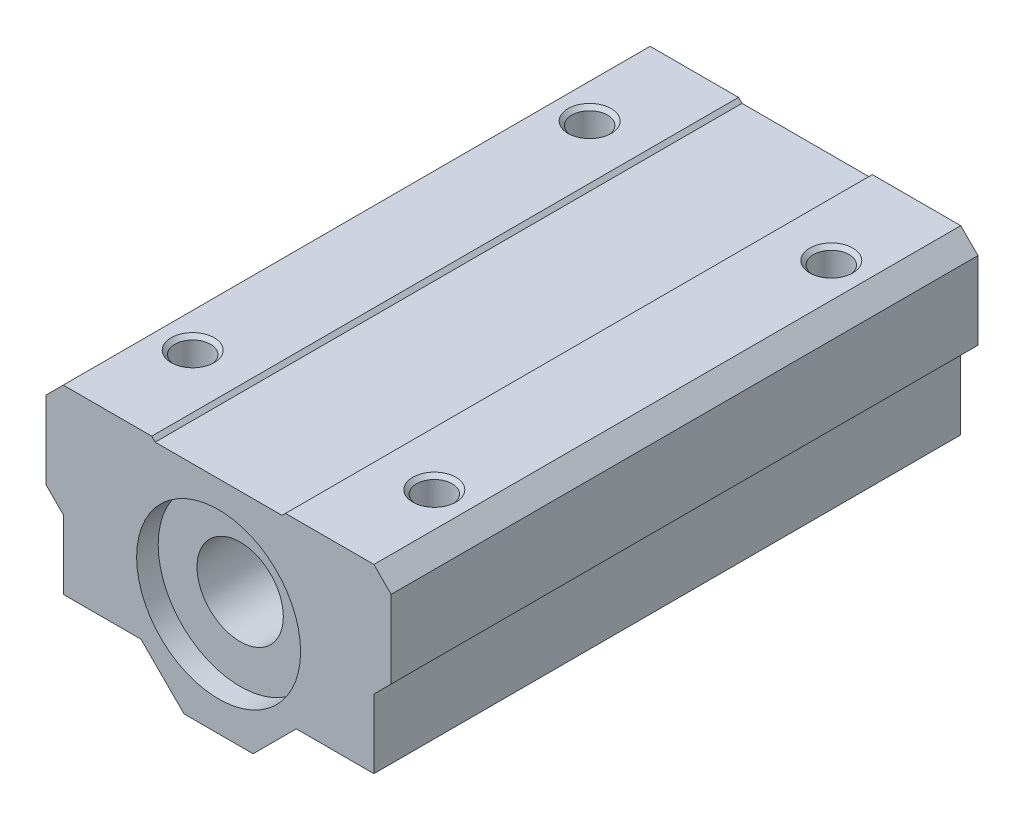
ISO-10303-21;
HEADER;
FILE_DESCRIPTION(('STEP AP214'),'2;1');
FILE_NAME('part.step','',(''),(''),'','','');
FILE_SCHEMA(('AUTOMOTIVE_DESIGN { 1 0 10303 214 1 1 1 1 }'));
ENDSEC;
DATA;
#1=APPLICATION_CONTEXT('core data for automotive mechanical design processes');
#2=APPLICATION_PROTOCOL_DEFINITION('international standard','automotive_design',2000,#1);
#3=PRODUCT_CONTEXT('',#1,'mechanical');
#4=PRODUCT('Part','Part','',(#3));
#5=PRODUCT_RELATED_PRODUCT_CATEGORY('part','',(#4));
#6=PRODUCT_DEFINITION_FORMATION('','',#4);
#7=PRODUCT_DEFINITION_CONTEXT('part definition',#1,'design');
#8=PRODUCT_DEFINITION('design','',#6,#7);
#9=PRODUCT_DEFINITION_SHAPE('','',#8);
#10=(LENGTH_UNIT() NAMED_UNIT(*) SI_UNIT(.MILLI.,.METRE.));
#11=(NAMED_UNIT(*) PLANE_ANGLE_UNIT() SI_UNIT($,.RADIAN.));
#12=(NAMED_UNIT(*) SI_UNIT($,.STERADIAN.) SOLID_ANGLE_UNIT());
#13=UNCERTAINTY_MEASURE_WITH_UNIT(LENGTH_MEASURE(1.E-05),#10,'distance_accuracy_value','');
#14=(GEOMETRIC_REPRESENTATION_CONTEXT(3) GLOBAL_UNCERTAINTY_ASSIGNED_CONTEXT((#13)) GLOBAL_UNIT_ASSIGNED_CONTEXT((#10,
#11,#12)) REPRESENTATION_CONTEXT('',''));
#15=CARTESIAN_POINT('',(0.,0.,0.));
#16=DIRECTION('',(0.,0.,1.));
#17=DIRECTION('',(1.,0.,0.));
#18=AXIS2_PLACEMENT_3D('',#15,#16,#17);
#19=CARTESIAN_POINT('',(-14.,13.,-11.));
#20=DIRECTION('',(0.,-1.,0.));
#21=DIRECTION('',(0.,0.,-1.));
#22=AXIS2_PLACEMENT_3D('',#19,#20,#21);
#23=CYLINDRICAL_SURFACE('',#22,2.067);
#24=CARTESIAN_POINT('',(-14.,-8.,-11.));
#25=DIRECTION('',(0.,-1.,0.));
#26=DIRECTION('',(0.,0.,-1.));
#27=AXIS2_PLACEMENT_3D('',#24,#25,#26);
#28=CIRCLE('',#27,2.067);
#29=CARTESIAN_POINT('',(-14.,-8.,-13.067));
#30=VERTEX_POINT('',#29);
#31=EDGE_CURVE('E19',#30,#30,#28,.F.);
#32=ORIENTED_EDGE('',*,*,#31,.F.);
#33=EDGE_LOOP('',(#32));
#34=FACE_BOUND('',#33,.T.);
#35=CARTESIAN_POINT('',(-14.,12.5670000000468,-11.));
#36=DIRECTION('',(0.,1.,0.));
#37=DIRECTION('',(0.,0.,1.));
#38=AXIS2_PLACEMENT_3D('',#35,#36,#37);
#39=CIRCLE('',#38,2.06699999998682);
#40=CARTESIAN_POINT('',(-14.,12.5670000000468,-8.93300000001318));
#41=VERTEX_POINT('',#40);
#42=EDGE_CURVE('E221',#41,#41,#39,.T.);
#43=ORIENTED_EDGE('',*,*,#42,.T.);
#44=EDGE_LOOP('',(#43));
#45=FACE_BOUND('',#44,.T.);
#46=ADVANCED_FACE('F16',(#34,#45),#23,.F.);
#47=CARTESIAN_POINT('',(-14.,13.,-57.));
#48=DIRECTION('',(0.,-1.,0.));
#49=DIRECTION('',(0.,0.,-1.));
#50=AXIS2_PLACEMENT_3D('',#47,#48,#49);
#51=CYLINDRICAL_SURFACE('',#50,2.067);
#52=CARTESIAN_POINT('',(-14.,-8.,-57.));
#53=DIRECTION('',(0.,-1.,0.));
#54=DIRECTION('',(0.,0.,-1.));
#55=AXIS2_PLACEMENT_3D('',#52,#53,#54);
#56=CIRCLE('',#55,2.067);
#57=CARTESIAN_POINT('',(-14.,-8.,-59.067));
#58=VERTEX_POINT('',#57);
#59=EDGE_CURVE('E208',#58,#58,#56,.F.);
#60=ORIENTED_EDGE('',*,*,#59,.F.);
#61=EDGE_LOOP('',(#60));
#62=FACE_BOUND('',#61,.T.);
#63=CARTESIAN_POINT('',(-14.,12.5670000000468,-57.));
#64=DIRECTION('',(0.,1.,0.));
#65=DIRECTION('',(0.,0.,1.));
#66=AXIS2_PLACEMENT_3D('',#63,#64,#65);
#67=CIRCLE('',#66,2.06699999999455);
#68=CARTESIAN_POINT('',(-14.,12.5670000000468,-54.9330000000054));
#69=VERTEX_POINT('',#68);
#70=EDGE_CURVE('E212',#69,#69,#67,.T.);
#71=ORIENTED_EDGE('',*,*,#70,.T.);
#72=EDGE_LOOP('',(#71));
#73=FACE_BOUND('',#72,.T.);
#74=ADVANCED_FACE('F272',(#62,#73),#51,.F.);
#75=CARTESIAN_POINT('',(14.,-8.,-11.));
#76=DIRECTION('',(0.,1.,0.));
#77=DIRECTION('',(0.,0.,1.));
#78=AXIS2_PLACEMENT_3D('',#75,#76,#77);
#79=CYLINDRICAL_SURFACE('',#78,2.067);
#80=CARTESIAN_POINT('',(14.,12.5670000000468,-11.));
#81=DIRECTION('',(0.,1.,0.));
#82=DIRECTION('',(0.,0.,1.));
#83=AXIS2_PLACEMENT_3D('',#80,#81,#82);
#84=CIRCLE('',#83,2.06699999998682);
#85=CARTESIAN_POINT('',(14.,12.5670000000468,-8.93300000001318));
#86=VERTEX_POINT('',#85);
#87=EDGE_CURVE('E233',#86,#86,#84,.T.);
#88=ORIENTED_EDGE('',*,*,#87,.T.);
#89=EDGE_LOOP('',(#88));
#90=FACE_BOUND('',#89,.T.);
#91=CARTESIAN_POINT('',(14.,-8.,-11.));
#92=DIRECTION('',(0.,1.,0.));
#93=DIRECTION('',(0.,0.,1.));
#94=AXIS2_PLACEMENT_3D('',#91,#92,#93);
#95=CIRCLE('',#94,2.067);
#96=CARTESIAN_POINT('',(14.,-8.,-8.933));
#97=VERTEX_POINT('',#96);
#98=EDGE_CURVE('E201',#97,#97,#95,.T.);
#99=ORIENTED_EDGE('',*,*,#98,.F.);
#100=EDGE_LOOP('',(#99));
#101=FACE_BOUND('',#100,.T.);
#102=ADVANCED_FACE('F275',(#90,#101),#79,.F.);
#103=CARTESIAN_POINT('',(14.,-8.,-57.));
#104=DIRECTION('',(0.,1.,0.));
#105=DIRECTION('',(0.,0.,1.));
#106=AXIS2_PLACEMENT_3D('',#103,#104,#105);
#107=CYLINDRICAL_SURFACE('',#106,2.067);
#108=CARTESIAN_POINT('',(14.,12.5670000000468,-57.));
#109=DIRECTION('',(0.,1.,0.));
#110=DIRECTION('',(0.,0.,1.));
#111=AXIS2_PLACEMENT_3D('',#108,#109,#110);
#112=CIRCLE('',#111,2.0670000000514);
#113=CARTESIAN_POINT('',(14.,12.5670000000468,-54.9329999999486));
#114=VERTEX_POINT('',#113);
#115=EDGE_CURVE('E230',#114,#114,#112,.T.);
#116=ORIENTED_EDGE('',*,*,#115,.T.);
#117=EDGE_LOOP('',(#116));
#118=FACE_BOUND('',#117,.T.);
#119=CARTESIAN_POINT('',(14.,-8.,-57.));
#120=DIRECTION('',(0.,1.,0.));
#121=DIRECTION('',(0.,0.,1.));
#122=AXIS2_PLACEMENT_3D('',#119,#120,#121);
#123=CIRCLE('',#122,2.067);
#124=CARTESIAN_POINT('',(14.,-8.,-54.933));
#125=VERTEX_POINT('',#124);
#126=EDGE_CURVE('E198',#125,#125,#123,.T.);
#127=ORIENTED_EDGE('',*,*,#126,.F.);
#128=EDGE_LOOP('',(#127));
#129=FACE_BOUND('',#128,.T.);
#130=ADVANCED_FACE('F513',(#118,#129),#107,.F.);
#131=CARTESIAN_POINT('',(14.,12.99999999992,-11.));
#132=DIRECTION('',(0.,1.,0.));
#133=DIRECTION('',(0.,0.,1.));
#134=AXIS2_PLACEMENT_3D('',#131,#132,#133);
#135=CONICAL_SURFACE('',#134,2.49999999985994,0.78539816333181);
#136=CARTESIAN_POINT('',(14.,12.9999999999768,-11.));
#137=DIRECTION('',(0.,1.,0.));
#138=DIRECTION('',(0.,0.,1.));
#139=AXIS2_PLACEMENT_3D('',#136,#137,#138);
#140=CIRCLE('',#139,2.49999999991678);
#141=CARTESIAN_POINT('',(14.,12.9999999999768,-8.50000000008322));
#142=VERTEX_POINT('',#141);
#143=EDGE_CURVE('E189',#142,#142,#140,.F.);
#144=ORIENTED_EDGE('',*,*,#143,.F.);
#145=EDGE_LOOP('',(#144));
#146=FACE_BOUND('',#145,.T.);
#147=ORIENTED_EDGE('',*,*,#87,.F.);
#148=EDGE_LOOP('',(#147));
#149=FACE_BOUND('',#148,.T.);
#150=ADVANCED_FACE('F510',(#146,#149),#135,.F.);
#151=CARTESIAN_POINT('',(14.,12.99999999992,-57.));
#152=DIRECTION('',(0.,1.,0.));
#153=DIRECTION('',(0.,0.,1.));
#154=AXIS2_PLACEMENT_3D('',#151,#152,#153);
#155=CONICAL_SURFACE('',#154,2.49999999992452,0.785398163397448);
#156=CARTESIAN_POINT('',(14.,12.9999999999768,-57.));
#157=DIRECTION('',(0.,1.,0.));
#158=DIRECTION('',(0.,0.,1.));
#159=AXIS2_PLACEMENT_3D('',#156,#157,#158);
#160=CIRCLE('',#159,2.49999999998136);
#161=CARTESIAN_POINT('',(14.,12.9999999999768,-54.5000000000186));
#162=VERTEX_POINT('',#161);
#163=EDGE_CURVE('E183',#162,#162,#160,.F.);
#164=ORIENTED_EDGE('',*,*,#163,.F.);
#165=EDGE_LOOP('',(#164));
#166=FACE_BOUND('',#165,.T.);
#167=ORIENTED_EDGE('',*,*,#115,.F.);
#168=EDGE_LOOP('',(#167));
#169=FACE_BOUND('',#168,.T.);
#170=ADVANCED_FACE('F311',(#166,#169),#155,.F.);
#171=CARTESIAN_POINT('',(7.75,13.,-68.));
#172=DIRECTION('',(-0.707106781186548,0.707106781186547,0.));
#173=DIRECTION('',(-0.707106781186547,-0.707106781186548,0.));
#174=AXIS2_PLACEMENT_3D('',#171,#172,#173);
#175=PLANE('',#174);
#176=DIRECTION('',(-0.707106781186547,-0.707106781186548,0.));
#177=VECTOR('',#176,1.);
#178=CARTESIAN_POINT('',(7.75,13.,-68.));
#179=LINE('',#178,#177);
#180=CARTESIAN_POINT('',(7.75,13.,-68.));
#181=VERTEX_POINT('',#180);
#182=CARTESIAN_POINT('',(7.35000000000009,12.6,-68.));
#183=VERTEX_POINT('',#182);
#184=EDGE_CURVE('E224',#181,#183,#179,.T.);
#185=ORIENTED_EDGE('',*,*,#184,.T.);
#186=DIRECTION('',(0.,0.,1.));
#187=VECTOR('',#186,1.);
#188=CARTESIAN_POINT('',(7.35000000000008,12.6,-68.));
#189=LINE('',#188,#187);
#190=CARTESIAN_POINT('',(7.35000000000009,12.6,0.));
#191=VERTEX_POINT('',#190);
#192=EDGE_CURVE('E180',#191,#183,#189,.F.);
#193=ORIENTED_EDGE('',*,*,#192,.F.);
#194=DIRECTION('',(-0.707106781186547,-0.707106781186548,0.));
#195=VECTOR('',#194,1.);
#196=CARTESIAN_POINT('',(7.75,13.,0.));
#197=LINE('',#196,#195);
#198=CARTESIAN_POINT('',(7.75,13.,0.));
#199=VERTEX_POINT('',#198);
#200=EDGE_CURVE('E228',#191,#199,#197,.F.);
#201=ORIENTED_EDGE('',*,*,#200,.T.);
#202=DIRECTION('',(0.,0.,1.));
#203=VECTOR('',#202,1.);
#204=CARTESIAN_POINT('',(7.75,13.,-68.));
#205=LINE('',#204,#203);
#206=EDGE_CURVE('E184',#181,#199,#205,.T.);
#207=ORIENTED_EDGE('',*,*,#206,.F.);
#208=EDGE_LOOP('',(#185,#193,#201,#207));
#209=FACE_BOUND('',#208,.T.);
#210=ADVANCED_FACE('F300',(#209),#175,.T.);
#211=CARTESIAN_POINT('',(-14.,13.0000000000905,-11.));
#212=DIRECTION('',(0.,1.,0.));
#213=DIRECTION('',(0.,0.,1.));
#214=AXIS2_PLACEMENT_3D('',#211,#212,#213);
#215=CONICAL_SURFACE('',#214,2.49999999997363,0.78539816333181);
#216=ORIENTED_EDGE('',*,*,#42,.F.);
#217=EDGE_LOOP('',(#216));
#218=FACE_BOUND('',#217,.T.);
#219=CARTESIAN_POINT('',(-14.,13.0000000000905,-11.));
#220=DIRECTION('',(0.,1.,0.));
#221=DIRECTION('',(0.,0.,1.));
#222=AXIS2_PLACEMENT_3D('',#219,#220,#221);
#223=CIRCLE('',#222,2.49999999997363);
#224=CARTESIAN_POINT('',(-14.,13.0000000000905,-8.50000000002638));
#225=VERTEX_POINT('',#224);
#226=EDGE_CURVE('E176',#225,#225,#223,.F.);
#227=ORIENTED_EDGE('',*,*,#226,.F.);
#228=EDGE_LOOP('',(#227));
#229=FACE_BOUND('',#228,.T.);
#230=ADVANCED_FACE('F298',(#218,#229),#215,.F.);
#231=CARTESIAN_POINT('',(-7.35000000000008,12.6,-68.));
#232=DIRECTION('',(0.707106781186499,0.707106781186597,0.));
#233=DIRECTION('',(-0.707106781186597,0.707106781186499,0.));
#234=AXIS2_PLACEMENT_3D('',#231,#232,#233);
#235=PLANE('',#234);
#236=DIRECTION('',(-0.707106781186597,0.707106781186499,0.));
#237=VECTOR('',#236,1.);
#238=CARTESIAN_POINT('',(-7.35000000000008,12.6,-68.));
#239=LINE('',#238,#237);
#240=CARTESIAN_POINT('',(-7.35000000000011,12.6,-68.));
#241=VERTEX_POINT('',#240);
#242=CARTESIAN_POINT('',(-7.75000000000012,13.,-68.));
#243=VERTEX_POINT('',#242);
#244=EDGE_CURVE('E215',#241,#243,#239,.T.);
#245=ORIENTED_EDGE('',*,*,#244,.T.);
#246=DIRECTION('',(0.,0.,1.));
#247=VECTOR('',#246,1.);
#248=CARTESIAN_POINT('',(-7.75000000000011,13.,-68.));
#249=LINE('',#248,#247);
#250=CARTESIAN_POINT('',(-7.75000000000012,13.,0.));
#251=VERTEX_POINT('',#250);
#252=EDGE_CURVE('E173',#251,#243,#249,.F.);
#253=ORIENTED_EDGE('',*,*,#252,.F.);
#254=DIRECTION('',(-0.707106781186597,0.707106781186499,0.));
#255=VECTOR('',#254,1.);
#256=CARTESIAN_POINT('',(-7.35000000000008,12.6,0.));
#257=LINE('',#256,#255);
#258=CARTESIAN_POINT('',(-7.35000000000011,12.6,0.));
#259=VERTEX_POINT('',#258);
#260=EDGE_CURVE('E219',#251,#259,#257,.F.);
#261=ORIENTED_EDGE('',*,*,#260,.T.);
#262=DIRECTION('',(0.,0.,1.));
#263=VECTOR('',#262,1.);
#264=CARTESIAN_POINT('',(-7.35000000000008,12.6,-68.));
#265=LINE('',#264,#263);
#266=EDGE_CURVE('E177',#241,#259,#265,.T.);
#267=ORIENTED_EDGE('',*,*,#266,.F.);
#268=EDGE_LOOP('',(#245,#253,#261,#267));
#269=FACE_BOUND('',#268,.T.);
#270=ADVANCED_FACE('F282',(#269),#235,.T.);
#271=CARTESIAN_POINT('',(-14.,13.0000000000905,-57.));
#272=DIRECTION('',(0.,1.,0.));
#273=DIRECTION('',(0.,0.,1.));
#274=AXIS2_PLACEMENT_3D('',#271,#272,#273);
#275=CONICAL_SURFACE('',#274,2.49999999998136,0.78539816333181);
#276=ORIENTED_EDGE('',*,*,#70,.F.);
#277=EDGE_LOOP('',(#276));
#278=FACE_BOUND('',#277,.T.);
#279=CARTESIAN_POINT('',(-14.,13.0000000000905,-57.));
#280=DIRECTION('',(0.,1.,0.));
#281=DIRECTION('',(0.,0.,1.));
#282=AXIS2_PLACEMENT_3D('',#279,#280,#281);
#283=CIRCLE('',#282,2.49999999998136);
#284=CARTESIAN_POINT('',(-14.,13.0000000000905,-54.5000000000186));
#285=VERTEX_POINT('',#284);
#286=EDGE_CURVE('E172',#285,#285,#283,.F.);
#287=ORIENTED_EDGE('',*,*,#286,.F.);
#288=EDGE_LOOP('',(#287));
#289=FACE_BOUND('',#288,.T.);
#290=ADVANCED_FACE('F278',(#278,#289),#275,.F.);
#291=CARTESIAN_POINT('',(-20.,11.,-68.));
#292=DIRECTION('',(-1.,0.,0.));
#293=DIRECTION('',(0.,0.,1.));
#294=AXIS2_PLACEMENT_3D('',#291,#292,#293);
#295=PLANE('',#294);
#296=DIRECTION('',(0.,1.,0.));
#297=VECTOR('',#296,1.);
#298=CARTESIAN_POINT('',(-20.,0.,-68.));
#299=LINE('',#298,#297);
#300=CARTESIAN_POINT('',(-20.,11.,-68.));
#301=VERTEX_POINT('',#300);
#302=CARTESIAN_POINT('',(-20.,2.,-68.));
#303=VERTEX_POINT('',#302);
#304=EDGE_CURVE('E401',#301,#303,#299,.F.);
#305=ORIENTED_EDGE('',*,*,#304,.T.);
#306=DIRECTION('',(0.,0.,1.));
#307=VECTOR('',#306,1.);
#308=CARTESIAN_POINT('',(-20.,2.,-68.));
#309=LINE('',#308,#307);
#310=CARTESIAN_POINT('',(-20.,2.,0.));
#311=VERTEX_POINT('',#310);
#312=EDGE_CURVE('E139',#311,#303,#309,.F.);
#313=ORIENTED_EDGE('',*,*,#312,.F.);
#314=DIRECTION('',(0.,1.,0.));
#315=VECTOR('',#314,1.);
#316=CARTESIAN_POINT('',(-20.,0.,0.));
#317=LINE('',#316,#315);
#318=CARTESIAN_POINT('',(-20.,11.,0.));
#319=VERTEX_POINT('',#318);
#320=EDGE_CURVE('E404',#319,#311,#317,.F.);
#321=ORIENTED_EDGE('',*,*,#320,.F.);
#322=DIRECTION('',(0.,0.,1.));
#323=VECTOR('',#322,1.);
#324=CARTESIAN_POINT('',(-20.,11.,-68.));
#325=LINE('',#324,#323);
#326=EDGE_CURVE('E165',#301,#319,#325,.T.);
#327=ORIENTED_EDGE('',*,*,#326,.F.);
#328=EDGE_LOOP('',(#305,#313,#321,#327));
#329=FACE_BOUND('',#328,.T.);
#330=ADVANCED_FACE('F281',(#329),#295,.T.);
#331=CARTESIAN_POINT('',(-20.,2.,-68.));
#332=DIRECTION('',(-0.707106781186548,-0.707106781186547,0.));
#333=DIRECTION('',(0.707106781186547,-0.707106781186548,0.));
#334=AXIS2_PLACEMENT_3D('',#331,#332,#333);
#335=PLANE('',#334);
#336=DIRECTION('',(0.707106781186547,-0.707106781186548,0.));
#337=VECTOR('',#336,1.);
#338=CARTESIAN_POINT('',(-20.,2.,-68.));
#339=LINE('',#338,#337);
#340=CARTESIAN_POINT('',(-18.,0.,-68.));
#341=VERTEX_POINT('',#340);
#342=EDGE_CURVE('E158',#303,#341,#339,.T.);
#343=ORIENTED_EDGE('',*,*,#342,.T.);
#344=DIRECTION('',(0.,0.,1.));
#345=VECTOR('',#344,1.);
#346=CARTESIAN_POINT('',(-18.,0.,-68.));
#347=LINE('',#346,#345);
#348=CARTESIAN_POINT('',(-18.,0.,0.));
#349=VERTEX_POINT('',#348);
#350=EDGE_CURVE('E146',#349,#341,#347,.F.);
#351=ORIENTED_EDGE('',*,*,#350,.F.);
#352=DIRECTION('',(0.707106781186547,-0.707106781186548,0.));
#353=VECTOR('',#352,1.);
#354=CARTESIAN_POINT('',(-20.,2.,0.));
#355=LINE('',#354,#353);
#356=EDGE_CURVE('E407',#311,#349,#355,.T.);
#357=ORIENTED_EDGE('',*,*,#356,.F.);
#358=ORIENTED_EDGE('',*,*,#312,.T.);
#359=EDGE_LOOP('',(#343,#351,#357,#358));
#360=FACE_BOUND('',#359,.T.);
#361=ADVANCED_FACE('F164',(#360),#335,.T.);
#362=CARTESIAN_POINT('',(-18.,0.,-68.));
#363=DIRECTION('',(-1.,0.,0.));
#364=DIRECTION('',(0.,0.,1.));
#365=AXIS2_PLACEMENT_3D('',#362,#363,#364);
#366=PLANE('',#365);
#367=DIRECTION('',(0.,1.,0.));
#368=VECTOR('',#367,1.);
#369=CARTESIAN_POINT('',(-18.,0.,-68.));
#370=LINE('',#369,#368);
#371=CARTESIAN_POINT('',(-18.,-8.,-68.));
#372=VERTEX_POINT('',#371);
#373=EDGE_CURVE('E150',#341,#372,#370,.F.);
#374=ORIENTED_EDGE('',*,*,#373,.T.);
#375=DIRECTION('',(0.,0.,-1.));
#376=VECTOR('',#375,1.);
#377=CARTESIAN_POINT('',(-18.,-8.,-68.));
#378=LINE('',#377,#376);
#379=CARTESIAN_POINT('',(-18.,-8.,0.));
#380=VERTEX_POINT('',#379);
#381=EDGE_CURVE('E209',#380,#372,#378,.T.);
#382=ORIENTED_EDGE('',*,*,#381,.F.);
#383=DIRECTION('',(0.,1.,0.));
#384=VECTOR('',#383,1.);
#385=CARTESIAN_POINT('',(-18.,0.,0.));
#386=LINE('',#385,#384);
#387=EDGE_CURVE('E151',#349,#380,#386,.F.);
#388=ORIENTED_EDGE('',*,*,#387,.F.);
#389=ORIENTED_EDGE('',*,*,#350,.T.);
#390=EDGE_LOOP('',(#374,#382,#388,#389));
#391=FACE_BOUND('',#390,.T.);
#392=ADVANCED_FACE('F148',(#391),#366,.T.);
#393=CARTESIAN_POINT('',(-18.,-8.,-68.));
#394=DIRECTION('',(0.,-1.,0.));
#395=DIRECTION('',(0.,0.,-1.));
#396=AXIS2_PLACEMENT_3D('',#393,#394,#395);
#397=PLANE('',#396);
#398=ORIENTED_EDGE('',*,*,#59,.T.);
#399=EDGE_LOOP('',(#398));
#400=FACE_BOUND('',#399,.T.);
#401=DIRECTION('',(1.,0.,0.));
#402=VECTOR('',#401,1.);
#403=CARTESIAN_POINT('',(0.,-8.,-68.));
#404=LINE('',#403,#402);
#405=CARTESIAN_POINT('',(-9.,-8.,-68.));
#406=VERTEX_POINT('',#405);
#407=EDGE_CURVE('E162',#372,#406,#404,.T.);
#408=ORIENTED_EDGE('',*,*,#407,.T.);
#409=DIRECTION('',(0.,0.,1.));
#410=VECTOR('',#409,1.);
#411=CARTESIAN_POINT('',(-9.,-8.,-68.));
#412=LINE('',#411,#410);
#413=CARTESIAN_POINT('',(-9.,-8.,0.));
#414=VERTEX_POINT('',#413);
#415=EDGE_CURVE('E206',#414,#406,#412,.F.);
#416=ORIENTED_EDGE('',*,*,#415,.F.);
#417=DIRECTION('',(1.,0.,0.));
#418=VECTOR('',#417,1.);
#419=CARTESIAN_POINT('',(0.,-8.,0.));
#420=LINE('',#419,#418);
#421=EDGE_CURVE('E446',#380,#414,#420,.T.);
#422=ORIENTED_EDGE('',*,*,#421,.F.);
#423=ORIENTED_EDGE('',*,*,#381,.T.);
#424=EDGE_LOOP('',(#408,#416,#422,#423));
#425=FACE_BOUND('',#424,.T.);
#426=ORIENTED_EDGE('',*,*,#31,.T.);
#427=EDGE_LOOP('',(#426));
#428=FACE_BOUND('',#427,.T.);
#429=ADVANCED_FACE('F269',(#400,#425,#428),#397,.T.);
#430=CARTESIAN_POINT('',(-9.,-8.,-68.));
#431=DIRECTION('',(-0.707106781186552,-0.707106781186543,0.));
#432=DIRECTION('',(0.707106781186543,-0.707106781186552,0.));
#433=AXIS2_PLACEMENT_3D('',#430,#431,#432);
#434=PLANE('',#433);
#435=DIRECTION('',(0.707106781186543,-0.707106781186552,0.));
#436=VECTOR('',#435,1.);
#437=CARTESIAN_POINT('',(-9.,-8.,-68.));
#438=LINE('',#437,#436);
#439=CARTESIAN_POINT('',(-4.,-13.,-68.));
#440=VERTEX_POINT('',#439);
#441=EDGE_CURVE('E440',#406,#440,#438,.T.);
#442=ORIENTED_EDGE('',*,*,#441,.T.);
#443=DIRECTION('',(0.,0.,-1.));
#444=VECTOR('',#443,1.);
#445=CARTESIAN_POINT('',(-4.,-13.,-68.));
#446=LINE('',#445,#444);
#447=CARTESIAN_POINT('',(-4.,-13.,0.));
#448=VERTEX_POINT('',#447);
#449=EDGE_CURVE('E204',#448,#440,#446,.T.);
#450=ORIENTED_EDGE('',*,*,#449,.F.);
#451=DIRECTION('',(0.707106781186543,-0.707106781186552,0.));
#452=VECTOR('',#451,1.);
#453=CARTESIAN_POINT('',(-9.,-8.,0.));
#454=LINE('',#453,#452);
#455=EDGE_CURVE('E447',#414,#448,#454,.T.);
#456=ORIENTED_EDGE('',*,*,#455,.F.);
#457=ORIENTED_EDGE('',*,*,#415,.T.);
#458=EDGE_LOOP('',(#442,#450,#456,#457));
#459=FACE_BOUND('',#458,.T.);
#460=ADVANCED_FACE('F385',(#459),#434,.T.);
#461=CARTESIAN_POINT('',(-4.,-13.,-68.));
#462=DIRECTION('',(0.,-1.,0.));
#463=DIRECTION('',(0.,0.,-1.));
#464=AXIS2_PLACEMENT_3D('',#461,#462,#463);
#465=PLANE('',#464);
#466=DIRECTION('',(1.,0.,0.));
#467=VECTOR('',#466,1.);
#468=CARTESIAN_POINT('',(0.,-13.,-68.));
#469=LINE('',#468,#467);
#470=CARTESIAN_POINT('',(4.,-13.,-68.));
#471=VERTEX_POINT('',#470);
#472=EDGE_CURVE('E437',#440,#471,#469,.T.);
#473=ORIENTED_EDGE('',*,*,#472,.T.);
#474=DIRECTION('',(0.,0.,1.));
#475=VECTOR('',#474,1.);
#476=CARTESIAN_POINT('',(4.,-13.,-68.));
#477=LINE('',#476,#475);
#478=CARTESIAN_POINT('',(4.,-13.,0.));
#479=VERTEX_POINT('',#478);
#480=EDGE_CURVE('E202',#479,#471,#477,.F.);
#481=ORIENTED_EDGE('',*,*,#480,.F.);
#482=DIRECTION('',(1.,0.,0.));
#483=VECTOR('',#482,1.);
#484=CARTESIAN_POINT('',(0.,-13.,0.));
#485=LINE('',#484,#483);
#486=EDGE_CURVE('E449',#448,#479,#485,.T.);
#487=ORIENTED_EDGE('',*,*,#486,.F.);
#488=ORIENTED_EDGE('',*,*,#449,.T.);
#489=EDGE_LOOP('',(#473,#481,#487,#488));
#490=FACE_BOUND('',#489,.T.);
#491=ADVANCED_FACE('F381',(#490),#465,.T.);
#492=CARTESIAN_POINT('',(4.,-13.,-68.));
#493=DIRECTION('',(0.707106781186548,-0.707106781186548,0.));
#494=DIRECTION('',(0.707106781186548,0.707106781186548,0.));
#495=AXIS2_PLACEMENT_3D('',#492,#493,#494);
#496=PLANE('',#495);
#497=DIRECTION('',(0.707106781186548,0.707106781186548,0.));
#498=VECTOR('',#497,1.);
#499=CARTESIAN_POINT('',(4.,-13.,-68.));
#500=LINE('',#499,#498);
#501=CARTESIAN_POINT('',(9.,-8.,-68.));
#502=VERTEX_POINT('',#501);
#503=EDGE_CURVE('E434',#471,#502,#500,.T.);
#504=ORIENTED_EDGE('',*,*,#503,.T.);
#505=DIRECTION('',(0.,0.,-1.));
#506=VECTOR('',#505,1.);
#507=CARTESIAN_POINT('',(9.,-8.,-68.));
#508=LINE('',#507,#506);
#509=CARTESIAN_POINT('',(9.,-8.,0.));
#510=VERTEX_POINT('',#509);
#511=EDGE_CURVE('E199',#510,#502,#508,.T.);
#512=ORIENTED_EDGE('',*,*,#511,.F.);
#513=DIRECTION('',(0.707106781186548,0.707106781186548,0.));
#514=VECTOR('',#513,1.);
#515=CARTESIAN_POINT('',(4.,-13.,0.));
#516=LINE('',#515,#514);
#517=EDGE_CURVE('E473',#479,#510,#516,.T.);
#518=ORIENTED_EDGE('',*,*,#517,.F.);
#519=ORIENTED_EDGE('',*,*,#480,.T.);
#520=EDGE_LOOP('',(#504,#512,#518,#519));
#521=FACE_BOUND('',#520,.T.);
#522=ADVANCED_FACE('F377',(#521),#496,.T.);
#523=CARTESIAN_POINT('',(9.,-8.,-68.));
#524=DIRECTION('',(0.,-1.,0.));
#525=DIRECTION('',(0.,0.,-1.));
#526=AXIS2_PLACEMENT_3D('',#523,#524,#525);
#527=PLANE('',#526);
#528=ORIENTED_EDGE('',*,*,#126,.T.);
#529=EDGE_LOOP('',(#528));
#530=FACE_BOUND('',#529,.T.);
#531=DIRECTION('',(1.,0.,0.));
#532=VECTOR('',#531,1.);
#533=CARTESIAN_POINT('',(0.,-8.,-68.));
#534=LINE('',#533,#532);
#535=CARTESIAN_POINT('',(18.,-8.,-68.));
#536=VERTEX_POINT('',#535);
#537=EDGE_CURVE('E431',#502,#536,#534,.T.);
#538=ORIENTED_EDGE('',*,*,#537,.T.);
#539=DIRECTION('',(0.,0.,-1.));
#540=VECTOR('',#539,1.);
#541=CARTESIAN_POINT('',(18.,-8.,-68.));
#542=LINE('',#541,#540);
#543=CARTESIAN_POINT('',(18.,-8.,0.));
#544=VERTEX_POINT('',#543);
#545=EDGE_CURVE('E196',#544,#536,#542,.T.);
#546=ORIENTED_EDGE('',*,*,#545,.F.);
#547=DIRECTION('',(1.,0.,0.));
#548=VECTOR('',#547,1.);
#549=CARTESIAN_POINT('',(0.,-8.,0.));
#550=LINE('',#549,#548);
#551=EDGE_CURVE('E471',#510,#544,#550,.T.);
#552=ORIENTED_EDGE('',*,*,#551,.F.);
#553=ORIENTED_EDGE('',*,*,#511,.T.);
#554=EDGE_LOOP('',(#538,#546,#552,#553));
#555=FACE_BOUND('',#554,.T.);
#556=ORIENTED_EDGE('',*,*,#98,.T.);
#557=EDGE_LOOP('',(#556));
#558=FACE_BOUND('',#557,.T.);
#559=ADVANCED_FACE('F373',(#530,#555,#558),#527,.T.);
#560=CARTESIAN_POINT('',(18.,-8.,-68.));
#561=DIRECTION('',(1.,0.,0.));
#562=DIRECTION('',(0.,0.,-1.));
#563=AXIS2_PLACEMENT_3D('',#560,#561,#562);
#564=PLANE('',#563);
#565=DIRECTION('',(0.,1.,0.));
#566=VECTOR('',#565,1.);
#567=CARTESIAN_POINT('',(18.,0.,-68.));
#568=LINE('',#567,#566);
#569=CARTESIAN_POINT('',(18.,0.,-68.));
#570=VERTEX_POINT('',#569);
#571=EDGE_CURVE('E428',#536,#570,#568,.T.);
#572=ORIENTED_EDGE('',*,*,#571,.T.);
#573=DIRECTION('',(0.,0.,1.));
#574=VECTOR('',#573,1.);
#575=CARTESIAN_POINT('',(18.,0.,-68.));
#576=LINE('',#575,#574);
#577=CARTESIAN_POINT('',(18.,0.,0.));
#578=VERTEX_POINT('',#577);
#579=EDGE_CURVE('E194',#578,#570,#576,.F.);
#580=ORIENTED_EDGE('',*,*,#579,.F.);
#581=DIRECTION('',(0.,1.,0.));
#582=VECTOR('',#581,1.);
#583=CARTESIAN_POINT('',(18.,0.,0.));
#584=LINE('',#583,#582);
#585=EDGE_CURVE('E469',#544,#578,#584,.T.);
#586=ORIENTED_EDGE('',*,*,#585,.F.);
#587=ORIENTED_EDGE('',*,*,#545,.T.);
#588=EDGE_LOOP('',(#572,#580,#586,#587));
#589=FACE_BOUND('',#588,.T.);
#590=ADVANCED_FACE('F369',(#589),#564,.T.);
#591=CARTESIAN_POINT('',(18.,0.,-68.));
#592=DIRECTION('',(0.707106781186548,-0.707106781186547,0.));
#593=DIRECTION('',(0.707106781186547,0.707106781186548,0.));
#594=AXIS2_PLACEMENT_3D('',#591,#592,#593);
#595=PLANE('',#594);
#596=DIRECTION('',(0.707106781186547,0.707106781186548,0.));
#597=VECTOR('',#596,1.);
#598=CARTESIAN_POINT('',(18.,0.,-68.));
#599=LINE('',#598,#597);
#600=CARTESIAN_POINT('',(20.,2.,-68.));
#601=VERTEX_POINT('',#600);
#602=EDGE_CURVE('E425',#570,#601,#599,.T.);
#603=ORIENTED_EDGE('',*,*,#602,.T.);
#604=DIRECTION('',(0.,0.,-1.));
#605=VECTOR('',#604,1.);
#606=CARTESIAN_POINT('',(20.,2.,-68.));
#607=LINE('',#606,#605);
#608=CARTESIAN_POINT('',(20.,2.,0.));
#609=VERTEX_POINT('',#608);
#610=EDGE_CURVE('E192',#609,#601,#607,.T.);
#611=ORIENTED_EDGE('',*,*,#610,.F.);
#612=DIRECTION('',(0.707106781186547,0.707106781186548,0.));
#613=VECTOR('',#612,1.);
#614=CARTESIAN_POINT('',(18.,0.,0.));
#615=LINE('',#614,#613);
#616=EDGE_CURVE('E467',#578,#609,#615,.T.);
#617=ORIENTED_EDGE('',*,*,#616,.F.);
#618=ORIENTED_EDGE('',*,*,#579,.T.);
#619=EDGE_LOOP('',(#603,#611,#617,#618));
#620=FACE_BOUND('',#619,.T.);
#621=ADVANCED_FACE('F365',(#620),#595,.T.);
#622=CARTESIAN_POINT('',(20.,2.,-68.));
#623=DIRECTION('',(1.,0.,0.));
#624=DIRECTION('',(0.,0.,-1.));
#625=AXIS2_PLACEMENT_3D('',#622,#623,#624);
#626=PLANE('',#625);
#627=DIRECTION('',(0.,1.,0.));
#628=VECTOR('',#627,1.);
#629=CARTESIAN_POINT('',(20.,0.,-68.));
#630=LINE('',#629,#628);
#631=CARTESIAN_POINT('',(20.,11.,-68.));
#632=VERTEX_POINT('',#631);
#633=EDGE_CURVE('E422',#601,#632,#630,.T.);
#634=ORIENTED_EDGE('',*,*,#633,.T.);
#635=DIRECTION('',(0.,0.,1.));
#636=VECTOR('',#635,1.);
#637=CARTESIAN_POINT('',(20.,11.,-68.));
#638=LINE('',#637,#636);
#639=CARTESIAN_POINT('',(20.,11.,0.));
#640=VERTEX_POINT('',#639);
#641=EDGE_CURVE('E190',#640,#632,#638,.F.);
#642=ORIENTED_EDGE('',*,*,#641,.F.);
#643=DIRECTION('',(0.,1.,0.));
#644=VECTOR('',#643,1.);
#645=CARTESIAN_POINT('',(20.,0.,0.));
#646=LINE('',#645,#644);
#647=EDGE_CURVE('E465',#609,#640,#646,.T.);
#648=ORIENTED_EDGE('',*,*,#647,.F.);
#649=ORIENTED_EDGE('',*,*,#610,.T.);
#650=EDGE_LOOP('',(#634,#642,#648,#649));
#651=FACE_BOUND('',#650,.T.);
#652=ADVANCED_FACE('F361',(#651),#626,.T.);
#653=CARTESIAN_POINT('',(20.,11.,-68.));
#654=DIRECTION('',(0.707106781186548,0.707106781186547,0.));
#655=DIRECTION('',(-0.707106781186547,0.707106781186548,0.));
#656=AXIS2_PLACEMENT_3D('',#653,#654,#655);
#657=PLANE('',#656);
#658=DIRECTION('',(-0.707106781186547,0.707106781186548,0.));
#659=VECTOR('',#658,1.);
#660=CARTESIAN_POINT('',(20.,11.,-68.));
#661=LINE('',#660,#659);
#662=CARTESIAN_POINT('',(18.,13.,-68.));
#663=VERTEX_POINT('',#662);
#664=EDGE_CURVE('E419',#632,#663,#661,.T.);
#665=ORIENTED_EDGE('',*,*,#664,.T.);
#666=DIRECTION('',(0.,0.,1.));
#667=VECTOR('',#666,1.);
#668=CARTESIAN_POINT('',(18.,13.,-68.));
#669=LINE('',#668,#667);
#670=CARTESIAN_POINT('',(18.,13.,0.));
#671=VERTEX_POINT('',#670);
#672=EDGE_CURVE('E187',#671,#663,#669,.F.);
#673=ORIENTED_EDGE('',*,*,#672,.F.);
#674=DIRECTION('',(-0.707106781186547,0.707106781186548,0.));
#675=VECTOR('',#674,1.);
#676=CARTESIAN_POINT('',(20.,11.,0.));
#677=LINE('',#676,#675);
#678=EDGE_CURVE('E463',#640,#671,#677,.T.);
#679=ORIENTED_EDGE('',*,*,#678,.F.);
#680=ORIENTED_EDGE('',*,*,#641,.T.);
#681=EDGE_LOOP('',(#665,#673,#679,#680));
#682=FACE_BOUND('',#681,.T.);
#683=ADVANCED_FACE('F357',(#682),#657,.T.);
#684=CARTESIAN_POINT('',(18.,13.,-68.));
#685=DIRECTION('',(0.,1.,0.));
#686=DIRECTION('',(0.,0.,1.));
#687=AXIS2_PLACEMENT_3D('',#684,#685,#686);
#688=PLANE('',#687);
#689=ORIENTED_EDGE('',*,*,#163,.T.);
#690=EDGE_LOOP('',(#689));
#691=FACE_BOUND('',#690,.T.);
#692=DIRECTION('',(1.,0.,0.));
#693=VECTOR('',#692,1.);
#694=CARTESIAN_POINT('',(0.,13.,-68.));
#695=LINE('',#694,#693);
#696=EDGE_CURVE('E416',#663,#181,#695,.F.);
#697=ORIENTED_EDGE('',*,*,#696,.T.);
#698=ORIENTED_EDGE('',*,*,#206,.T.);
#699=DIRECTION('',(1.,0.,0.));
#700=VECTOR('',#699,1.);
#701=CARTESIAN_POINT('',(0.,13.,0.));
#702=LINE('',#701,#700);
#703=EDGE_CURVE('E460',#671,#199,#702,.F.);
#704=ORIENTED_EDGE('',*,*,#703,.F.);
#705=ORIENTED_EDGE('',*,*,#672,.T.);
#706=EDGE_LOOP('',(#697,#698,#704,#705));
#707=FACE_BOUND('',#706,.T.);
#708=ORIENTED_EDGE('',*,*,#143,.T.);
#709=EDGE_LOOP('',(#708));
#710=FACE_BOUND('',#709,.T.);
#711=ADVANCED_FACE('F353',(#691,#707,#710),#688,.T.);
#712=CARTESIAN_POINT('',(7.35000000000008,12.6,-68.));
#713=DIRECTION('',(0.,1.,0.));
#714=DIRECTION('',(-1.,0.,0.));
#715=AXIS2_PLACEMENT_3D('',#712,#713,#714);
#716=PLANE('',#715);
#717=DIRECTION('',(1.,0.,0.));
#718=VECTOR('',#717,1.);
#719=CARTESIAN_POINT('',(0.,12.6,-68.));
#720=LINE('',#719,#718);
#721=EDGE_CURVE('E413',#183,#241,#720,.F.);
#722=ORIENTED_EDGE('',*,*,#721,.T.);
#723=ORIENTED_EDGE('',*,*,#266,.T.);
#724=DIRECTION('',(1.,0.,0.));
#725=VECTOR('',#724,1.);
#726=CARTESIAN_POINT('',(0.,12.6,0.));
#727=LINE('',#726,#725);
#728=EDGE_CURVE('E455',#191,#259,#727,.F.);
#729=ORIENTED_EDGE('',*,*,#728,.F.);
#730=ORIENTED_EDGE('',*,*,#192,.T.);
#731=EDGE_LOOP('',(#722,#723,#729,#730));
#732=FACE_BOUND('',#731,.T.);
#733=ADVANCED_FACE('F290',(#732),#716,.T.);
#734=CARTESIAN_POINT('',(-7.75000000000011,13.,-68.));
#735=DIRECTION('',(0.,1.,0.));
#736=DIRECTION('',(0.,0.,1.));
#737=AXIS2_PLACEMENT_3D('',#734,#735,#736);
#738=PLANE('',#737);
#739=ORIENTED_EDGE('',*,*,#286,.T.);
#740=EDGE_LOOP('',(#739));
#741=FACE_BOUND('',#740,.T.);
#742=DIRECTION('',(1.,0.,0.));
#743=VECTOR('',#742,1.);
#744=CARTESIAN_POINT('',(0.,13.,-68.));
#745=LINE('',#744,#743);
#746=CARTESIAN_POINT('',(-18.,13.,-68.));
#747=VERTEX_POINT('',#746);
#748=EDGE_CURVE('E295',#243,#747,#745,.F.);
#749=ORIENTED_EDGE('',*,*,#748,.T.);
#750=DIRECTION('',(0.,0.,1.));
#751=VECTOR('',#750,1.);
#752=CARTESIAN_POINT('',(-18.,13.,-68.));
#753=LINE('',#752,#751);
#754=CARTESIAN_POINT('',(-18.,13.,0.));
#755=VERTEX_POINT('',#754);
#756=EDGE_CURVE('E167',#755,#747,#753,.F.);
#757=ORIENTED_EDGE('',*,*,#756,.F.);
#758=DIRECTION('',(1.,0.,0.));
#759=VECTOR('',#758,1.);
#760=CARTESIAN_POINT('',(0.,13.,0.));
#761=LINE('',#760,#759);
#762=EDGE_CURVE('E34',#251,#755,#761,.F.);
#763=ORIENTED_EDGE('',*,*,#762,.F.);
#764=ORIENTED_EDGE('',*,*,#252,.T.);
#765=EDGE_LOOP('',(#749,#757,#763,#764));
#766=FACE_BOUND('',#765,.T.);
#767=ORIENTED_EDGE('',*,*,#226,.T.);
#768=EDGE_LOOP('',(#767));
#769=FACE_BOUND('',#768,.T.);
#770=ADVANCED_FACE('F286',(#741,#766,#769),#738,.T.);
#771=CARTESIAN_POINT('',(-18.,13.,-68.));
#772=DIRECTION('',(-0.707106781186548,0.707106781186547,0.));
#773=DIRECTION('',(-0.707106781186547,-0.707106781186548,0.));
#774=AXIS2_PLACEMENT_3D('',#771,#772,#773);
#775=PLANE('',#774);
#776=DIRECTION('',(-0.707106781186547,-0.707106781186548,0.));
#777=VECTOR('',#776,1.);
#778=CARTESIAN_POINT('',(-18.,13.,-68.));
#779=LINE('',#778,#777);
#780=EDGE_CURVE('E405',#747,#301,#779,.T.);
#781=ORIENTED_EDGE('',*,*,#780,.T.);
#782=ORIENTED_EDGE('',*,*,#326,.T.);
#783=DIRECTION('',(-0.707106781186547,-0.707106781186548,0.));
#784=VECTOR('',#783,1.);
#785=CARTESIAN_POINT('',(-18.,13.,0.));
#786=LINE('',#785,#784);
#787=EDGE_CURVE('E254',#755,#319,#786,.T.);
#788=ORIENTED_EDGE('',*,*,#787,.F.);
#789=ORIENTED_EDGE('',*,*,#756,.T.);
#790=EDGE_LOOP('',(#781,#782,#788,#789));
#791=FACE_BOUND('',#790,.T.);
#792=ADVANCED_FACE('F289',(#791),#775,.T.);
#793=CARTESIAN_POINT('',(0.,0.,-68.));
#794=DIRECTION('',(0.,0.,1.));
#795=DIRECTION('',(1.,0.,0.));
#796=AXIS2_PLACEMENT_3D('',#793,#794,#795);
#797=PLANE('',#796);
#798=CARTESIAN_POINT('',(0.,0.,-68.));
#799=DIRECTION('',(0.,0.,1.));
#800=DIRECTION('',(1.,0.,0.));
#801=AXIS2_PLACEMENT_3D('',#798,#799,#800);
#802=CIRCLE('',#801,9.5);
#803=CARTESIAN_POINT('',(9.5,0.,-68.));
#804=VERTEX_POINT('',#803);
#805=EDGE_CURVE('E251',#804,#804,#802,.T.);
#806=ORIENTED_EDGE('',*,*,#805,.T.);
#807=EDGE_LOOP('',(#806));
#808=FACE_BOUND('',#807,.T.);
#809=ORIENTED_EDGE('',*,*,#780,.F.);
#810=ORIENTED_EDGE('',*,*,#748,.F.);
#811=ORIENTED_EDGE('',*,*,#244,.F.);
#812=ORIENTED_EDGE('',*,*,#721,.F.);
#813=ORIENTED_EDGE('',*,*,#184,.F.);
#814=ORIENTED_EDGE('',*,*,#696,.F.);
#815=ORIENTED_EDGE('',*,*,#664,.F.);
#816=ORIENTED_EDGE('',*,*,#633,.F.);
#817=ORIENTED_EDGE('',*,*,#602,.F.);
#818=ORIENTED_EDGE('',*,*,#571,.F.);
#819=ORIENTED_EDGE('',*,*,#537,.F.);
#820=ORIENTED_EDGE('',*,*,#503,.F.);
#821=ORIENTED_EDGE('',*,*,#472,.F.);
#822=ORIENTED_EDGE('',*,*,#441,.F.);
#823=ORIENTED_EDGE('',*,*,#407,.F.);
#824=ORIENTED_EDGE('',*,*,#373,.F.);
#825=ORIENTED_EDGE('',*,*,#342,.F.);
#826=ORIENTED_EDGE('',*,*,#304,.F.);
#827=EDGE_LOOP('',(#809,#810,#811,#812,#813,#814,#815,#816,#817,#818,#819,#820,#821,#822,#823,
#824,#825,#826));
#828=FACE_BOUND('',#827,.T.);
#829=ADVANCED_FACE('F156',(#808,#828),#797,.F.);
#830=CARTESIAN_POINT('',(0.,0.,0.));
#831=DIRECTION('',(0.,0.,1.));
#832=DIRECTION('',(1.,0.,0.));
#833=AXIS2_PLACEMENT_3D('',#830,#831,#832);
#834=PLANE('',#833);
#835=CARTESIAN_POINT('',(0.,0.,0.));
#836=DIRECTION('',(0.,0.,1.));
#837=DIRECTION('',(1.,0.,0.));
#838=AXIS2_PLACEMENT_3D('',#835,#836,#837);
#839=CIRCLE('',#838,9.5);
#840=CARTESIAN_POINT('',(9.5,0.,0.));
#841=VERTEX_POINT('',#840);
#842=EDGE_CURVE('E248',#841,#841,#839,.F.);
#843=ORIENTED_EDGE('',*,*,#842,.T.);
#844=EDGE_LOOP('',(#843));
#845=FACE_BOUND('',#844,.T.);
#846=ORIENTED_EDGE('',*,*,#762,.T.);
#847=ORIENTED_EDGE('',*,*,#787,.T.);
#848=ORIENTED_EDGE('',*,*,#320,.T.);
#849=ORIENTED_EDGE('',*,*,#356,.T.);
#850=ORIENTED_EDGE('',*,*,#387,.T.);
#851=ORIENTED_EDGE('',*,*,#421,.T.);
#852=ORIENTED_EDGE('',*,*,#455,.T.);
#853=ORIENTED_EDGE('',*,*,#486,.T.);
#854=ORIENTED_EDGE('',*,*,#517,.T.);
#855=ORIENTED_EDGE('',*,*,#551,.T.);
#856=ORIENTED_EDGE('',*,*,#585,.T.);
#857=ORIENTED_EDGE('',*,*,#616,.T.);
#858=ORIENTED_EDGE('',*,*,#647,.T.);
#859=ORIENTED_EDGE('',*,*,#678,.T.);
#860=ORIENTED_EDGE('',*,*,#703,.T.);
#861=ORIENTED_EDGE('',*,*,#200,.F.);
#862=ORIENTED_EDGE('',*,*,#728,.T.);
#863=ORIENTED_EDGE('',*,*,#260,.F.);
#864=EDGE_LOOP('',(#846,#847,#848,#849,#850,#851,#852,#853,#854,#855,#856,#857,#858,#859,#860,
#861,#862,#863));
#865=FACE_BOUND('',#864,.T.);
#866=ADVANCED_FACE('F340',(#845,#865),#834,.T.);
#867=CARTESIAN_POINT('',(0.,0.,-68.));
#868=DIRECTION('',(0.,0.,1.));
#869=DIRECTION('',(1.,0.,0.));
#870=AXIS2_PLACEMENT_3D('',#867,#868,#869);
#871=CYLINDRICAL_SURFACE('',#870,9.5);
#872=CARTESIAN_POINT('',(0.,0.,-65.5));
#873=DIRECTION('',(0.,0.,1.));
#874=DIRECTION('',(1.,0.,0.));
#875=AXIS2_PLACEMENT_3D('',#872,#873,#874);
#876=CIRCLE('',#875,9.5);
#877=CARTESIAN_POINT('',(9.5,0.,-65.5));
#878=VERTEX_POINT('',#877);
#879=EDGE_CURVE('E245',#878,#878,#876,.F.);
#880=ORIENTED_EDGE('',*,*,#879,.F.);
#881=EDGE_LOOP('',(#880));
#882=FACE_BOUND('',#881,.T.);
#883=ORIENTED_EDGE('',*,*,#805,.F.);
#884=EDGE_LOOP('',(#883));
#885=FACE_BOUND('',#884,.T.);
#886=ADVANCED_FACE('F336',(#882,#885),#871,.F.);
#887=CARTESIAN_POINT('',(0.,0.,-68.));
#888=DIRECTION('',(0.,0.,1.));
#889=DIRECTION('',(1.,0.,0.));
#890=AXIS2_PLACEMENT_3D('',#887,#888,#889);
#891=CYLINDRICAL_SURFACE('',#890,9.5);
#892=ORIENTED_EDGE('',*,*,#842,.F.);
#893=EDGE_LOOP('',(#892));
#894=FACE_BOUND('',#893,.T.);
#895=CARTESIAN_POINT('',(0.,0.,-2.49999999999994));
#896=DIRECTION('',(0.,0.,1.));
#897=DIRECTION('',(1.,0.,0.));
#898=AXIS2_PLACEMENT_3D('',#895,#896,#897);
#899=CIRCLE('',#898,9.5);
#900=CARTESIAN_POINT('',(9.5,0.,-2.49999999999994));
#901=VERTEX_POINT('',#900);
#902=EDGE_CURVE('E242',#901,#901,#899,.T.);
#903=ORIENTED_EDGE('',*,*,#902,.F.);
#904=EDGE_LOOP('',(#903));
#905=FACE_BOUND('',#904,.T.);
#906=ADVANCED_FACE('F332',(#894,#905),#891,.F.);
#907=CARTESIAN_POINT('',(0.,5.,-65.5));
#908=DIRECTION('',(0.,0.,-1.));
#909=DIRECTION('',(-1.,0.,0.));
#910=AXIS2_PLACEMENT_3D('',#907,#908,#909);
#911=PLANE('',#910);
#912=CARTESIAN_POINT('',(0.,0.,-65.5));
#913=DIRECTION('',(0.,0.,1.));
#914=DIRECTION('',(1.,0.,0.));
#915=AXIS2_PLACEMENT_3D('',#912,#913,#914);
#916=CIRCLE('',#915,5.);
#917=CARTESIAN_POINT('',(5.,0.,-65.5));
#918=VERTEX_POINT('',#917);
#919=EDGE_CURVE('E25',#918,#918,#916,.T.);
#920=ORIENTED_EDGE('',*,*,#919,.T.);
#921=EDGE_LOOP('',(#920));
#922=FACE_BOUND('',#921,.T.);
#923=ORIENTED_EDGE('',*,*,#879,.T.);
#924=EDGE_LOOP('',(#923));
#925=FACE_BOUND('',#924,.T.);
#926=ADVANCED_FACE('F324',(#922,#925),#911,.T.);
#927=CARTESIAN_POINT('',(0.,9.5,-2.49999999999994));
#928=DIRECTION('',(0.,0.,1.));
#929=DIRECTION('',(1.,0.,0.));
#930=AXIS2_PLACEMENT_3D('',#927,#928,#929);
#931=PLANE('',#930);
#932=ORIENTED_EDGE('',*,*,#902,.T.);
#933=EDGE_LOOP('',(#932));
#934=FACE_BOUND('',#933,.T.);
#935=CARTESIAN_POINT('',(0.,0.,-2.49999999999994));
#936=DIRECTION('',(0.,0.,1.));
#937=DIRECTION('',(1.,0.,0.));
#938=AXIS2_PLACEMENT_3D('',#935,#936,#937);
#939=CIRCLE('',#938,5.);
#940=CARTESIAN_POINT('',(5.,0.,-2.49999999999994));
#941=VERTEX_POINT('',#940);
#942=EDGE_CURVE('E11',#941,#941,#939,.F.);
#943=ORIENTED_EDGE('',*,*,#942,.T.);
#944=EDGE_LOOP('',(#943));
#945=FACE_BOUND('',#944,.T.);
#946=ADVANCED_FACE('F317',(#934,#945),#931,.T.);
#947=CARTESIAN_POINT('',(0.,0.,-68.));
#948=DIRECTION('',(0.,0.,1.));
#949=DIRECTION('',(1.,0.,0.));
#950=AXIS2_PLACEMENT_3D('',#947,#948,#949);
#951=CYLINDRICAL_SURFACE('',#950,5.);
#952=ORIENTED_EDGE('',*,*,#942,.F.);
#953=EDGE_LOOP('',(#952));
#954=FACE_BOUND('',#953,.T.);
#955=ORIENTED_EDGE('',*,*,#919,.F.);
#956=EDGE_LOOP('',(#955));
#957=FACE_BOUND('',#956,.T.);
#958=ADVANCED_FACE('F315',(#954,#957),#951,.F.);
#959=CLOSED_SHELL('',(#46,#74,#102,#130,#150,#170,#210,#230,#270,#290,#330,#361,#392,#429,#460,
#491,#522,#559,#590,#621,#652,#683,#711,#733,#770,#792,#829,#866,#886,#906,#926,#946,#958));
#960=MANIFOLD_SOLID_BREP('B1',#959);
#961=ADVANCED_BREP_SHAPE_REPRESENTATION('',(#18,#960),#14);
#962=SHAPE_DEFINITION_REPRESENTATION(#9,#961);
ENDSEC;
END-ISO-10303-21;
